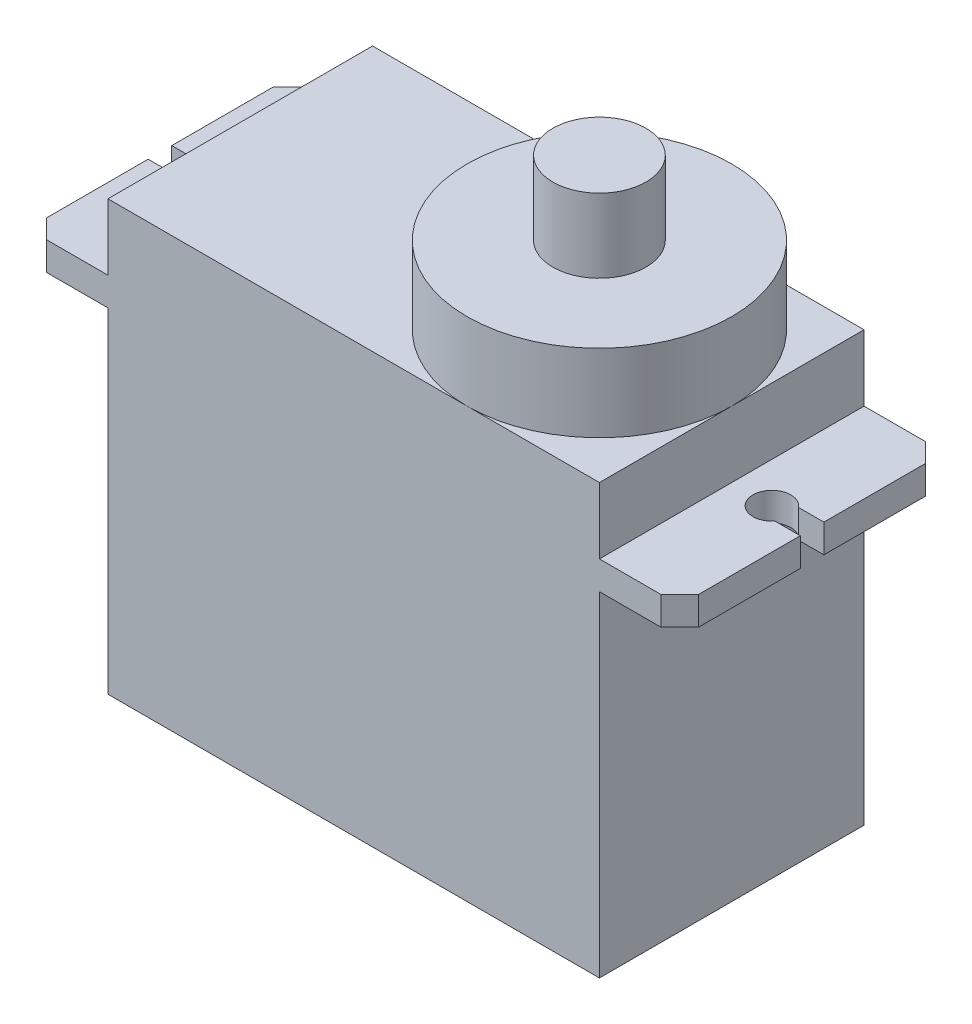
from build123d import *

# Parameters (mm, degrees)
SKETCH1_W           = 26
SKETCH1_H           = 14
BOSS_EXTRUDE1_DEPTH = 22.7
SKETCH2_W           = 34.5
SKETCH2_H           = 14
BOSS_EXTRUDE2_DEPTH = 1.5
CHAMFER1_SIZE       = 1
SKETCH3_R           = 7
BOSS_EXTRUDE3_DEPTH = 26.8
SKETCH4_R           = 2.465
BOSS_EXTRUDE4_DEPTH = 3.9
SKETCH5_R           = 1
CUT_EXTRUDE1_DEPTH  = 39.466901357
SKETCH7_W           = 4.817382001
SKETCH7_H           = 1.25
SKETCH7_W_2         = 10.544713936
CUT_EXTRUDE2_DEPTH  = 39.466901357


with BuildPart() as part:
    # Sketch1 → Boss-Extrude1 (new body)
    with BuildSketch(Plane(origin=(0, 0, 0), x_dir=(1, 0, 0), z_dir=(0, 1, 0))):
        with Locations((13, 7)):
            Rectangle(SKETCH1_W, SKETCH1_H)
    extrude(amount=BOSS_EXTRUDE1_DEPTH)

    # Sketch2 → Boss-Extrude2 (add)
    with BuildSketch(Plane(origin=(0, 19.2, 0), x_dir=(1, 0, 0), z_dir=(0, 1, 0))):
        with Locations((13, 7)):
            Rectangle(SKETCH2_W, SKETCH2_H)
    extrude(amount=-BOSS_EXTRUDE2_DEPTH)

    # Chamfer1
    chamfer1_edges = [part.edges().sort_by_distance(p)[0] for p in [
        (-4.25, 18.45, -14),
        (30.25, 18.45, 0),
        (-4.25, 18.45, 0),
        (30.25, 18.45, -14),
    ]]
    chamfer(chamfer1_edges, length=CHAMFER1_SIZE)

    # Sketch3 → Boss-Extrude3 (add)
    with BuildSketch(Plane.XZ):
        with Locations(Location((19, -7, 0), (0, 0, 270))):
            Circle(SKETCH3_R)
    extrude(amount=-BOSS_EXTRUDE3_DEPTH)

    # Sketch4 → Boss-Extrude4 (add)
    with BuildSketch(Plane(origin=(0, 26.8, 0), x_dir=(1, 0, 0), z_dir=(0, 1, 0))):
        with Locations(Location((19, 7, 0), (0, 0, 270))):
            Circle(SKETCH4_R)
    extrude(amount=BOSS_EXTRUDE4_DEPTH)

    # Sketch5 → Cut-Extrude1 (cut, through all)
    with BuildSketch(Plane(origin=(0, 19.2, 0), x_dir=(1, 0, 0), z_dir=(0, 1, 0))):
        with Locations(Location((28.125, 7, 0), (0, 0, 270))):
            Circle(SKETCH5_R)
        with Locations(Location((-2.125, 7, 0), (0, 0, 270))):
            Circle(SKETCH5_R)
    extrude(amount=-CUT_EXTRUDE1_DEPTH, mode=Mode.SUBTRACT)

    # Sketch7 → Cut-Extrude2 (cut, through all)
    with BuildSketch(Plane(origin=(0, 19.2, 0), x_dir=(1, 0, 0), z_dir=(0, 1, 0))):
        with Locations((30.431785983, 7)):
            Rectangle(SKETCH7_W, SKETCH7_H)
        with Locations((-7.29545195, 7)):
            Rectangle(SKETCH7_W_2, SKETCH7_H)
    extrude(amount=-CUT_EXTRUDE2_DEPTH, mode=Mode.SUBTRACT)


solid = part.part
